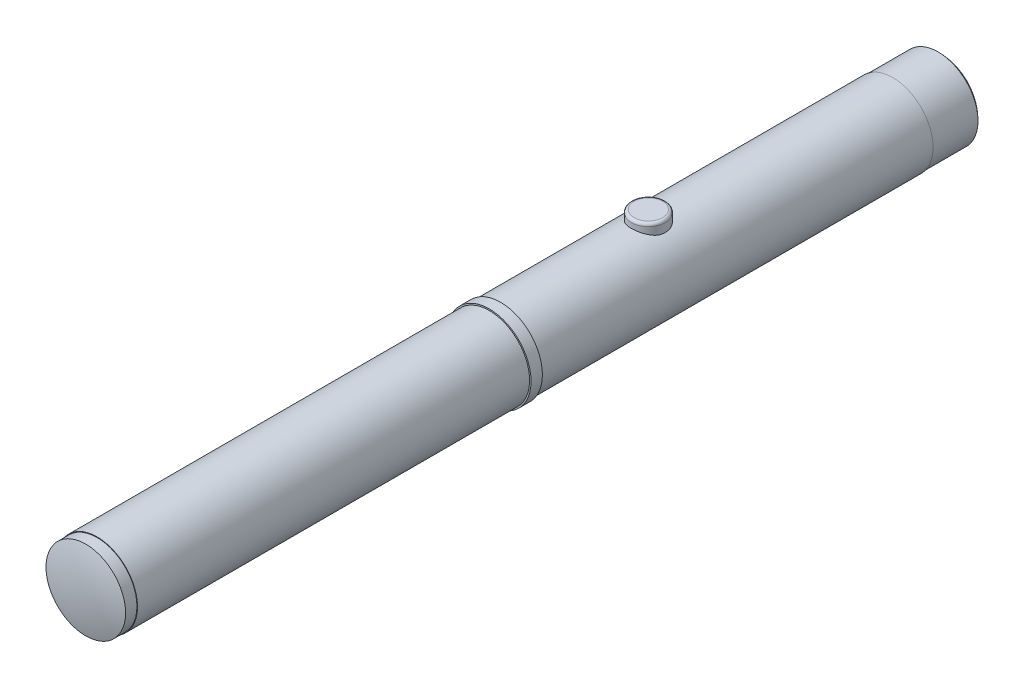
from build123d import *

# Parameters (mm, degrees)
CROQUIS2_R              = 7.1
SALIENTE_EXTRUIR1_DEPTH = 140
CROQUIS4_W              = 0.5
CROQUIS4_H              = 2
CROQUIS5_R              = 3
SALIENTE_EXTRUIR2_DEPTH = 2
REDONDEO1_R             = 0.5


with BuildPart() as part:
    # Croquis2 → Saliente-Extruir1 (new body)
    with BuildSketch(Plane.XY):
        Circle(CROQUIS2_R)
    extrude(amount=SALIENTE_EXTRUIR1_DEPTH)

    # Croquis4 → Revoluci_n1 (revolve)
    with BuildSketch(Plane(origin=(0, 0, 0), x_dir=(1, 0, 0), z_dir=(0, 1, 0)), mode=Mode.PRIVATE) as revoluci_n1_sk:
        with BuildLine():
            Line((-7, -142), (-7, -140))
            Line((-7, -140), (0, -140))
            Line((0, -140), (0, -143))
            ThreePointArc((0, -143), (-3.535533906, -142.748737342), (-7, -142))
        make_face()
        with BuildLine():
            Line((-2.25, 0), (-2.25, 10))
            ThreePointArc((-2.25, 10), (-4.826941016, 9.479609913), (-7, 8))
            Line((-7, 8), (-7, 0))
            Line((-7, 0), (-2.25, 0))
        make_face()
        with Locations((-7.1, -70)):
            Rectangle(CROQUIS4_W, CROQUIS4_H)
    revolve(revoluci_n1_sk.sketch.rotate(Axis((0, 0, 0), (0, 0, -1)), 180), axis=Axis((0, 0, 0), (0, 0, -1)))

    # Croquis5 → Saliente-Extruir2 (add)
    with BuildSketch(Plane(origin=(0, 6.5, 0), x_dir=(1, 0, 0), z_dir=(0, 1, 0))):
        with Locations(Location((0, -43, 0), (0, 0, 162.211448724))):
            Circle(CROQUIS5_R)
    extrude(amount=SALIENTE_EXTRUIR2_DEPTH)

    # Redondeo1
    redondeo1_edges = [part.edges().sort_by_distance(p)[0] for p in [
        (2.856571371, 8.5, 43.916515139),
    ]]
    fillet(redondeo1_edges, radius=REDONDEO1_R)


solid = part.part
